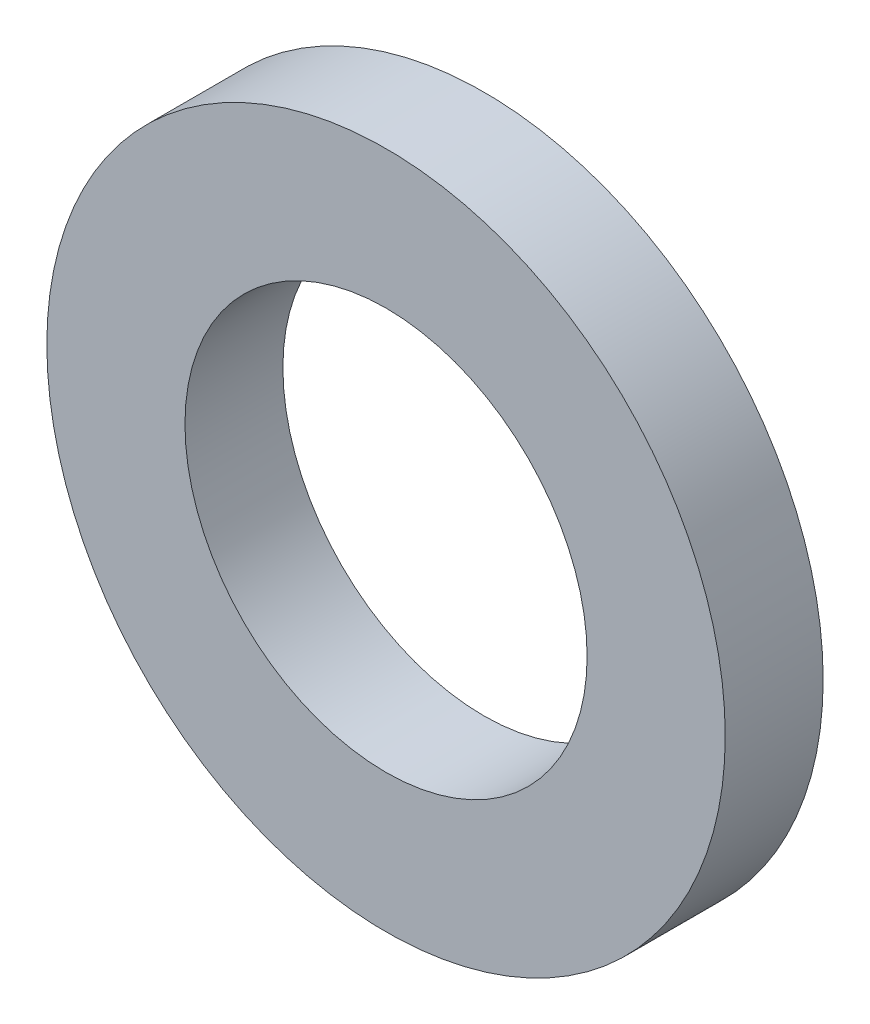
from build123d import *

# Parameters (mm, degrees)
ESQUISSE1_R          = 9.7
ESQUISSE1_R_2        = 5.75
BASE_EXTRUSION_DEPTH = 2.8


with BuildPart() as part:
    # Esquisse1 → Base-Extrusion (new body)
    with BuildSketch(Plane.XY):
        Circle(ESQUISSE1_R)
        Circle(ESQUISSE1_R_2, mode=Mode.SUBTRACT)
    extrude(amount=BASE_EXTRUSION_DEPTH)


solid = part.part
